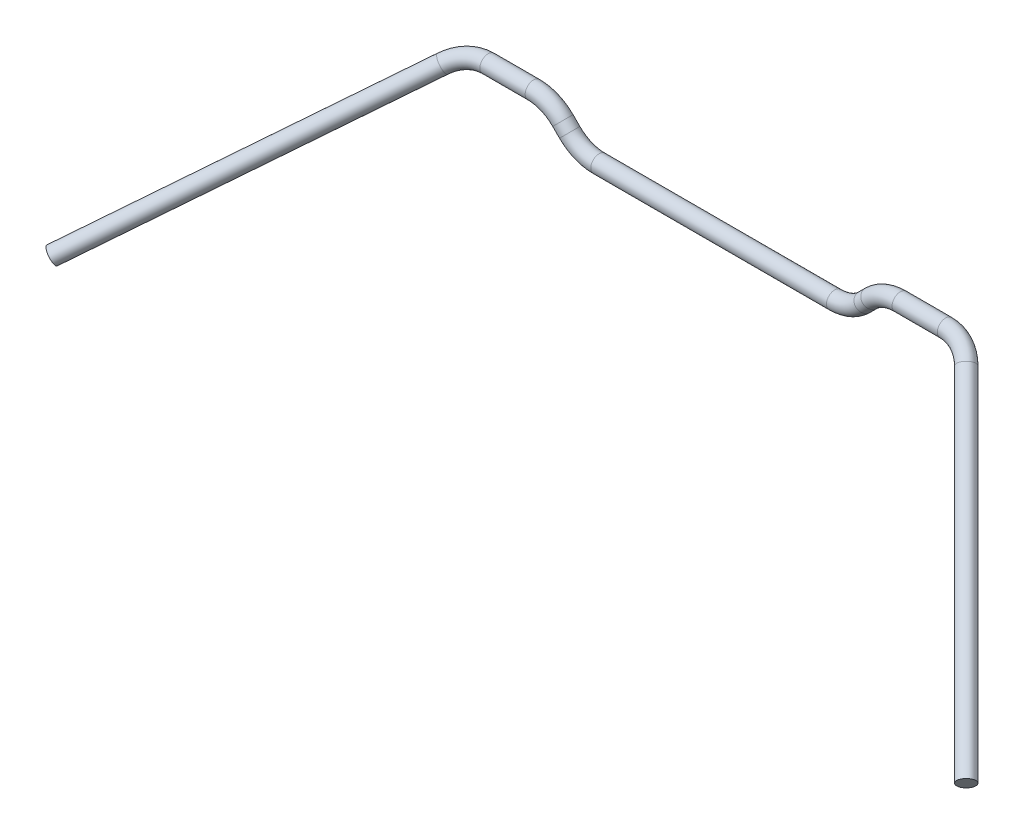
from build123d import *

# Parameters (mm, degrees)
ESQUISSE2_R = 0.4


with BuildPart() as part:
    # Balayage1: sweep along a curve in space
    with BuildLine() as balayage1_path:
        Line((0, 0, 0), (5.671572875, 0, 0))
        ThreePointArc((7.085786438, 0.585786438, 0), (6.43693974, 0.152240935, 0), (5.671572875, 0, 0))
        Line((7.085786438, 0.585786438, 0), (7.414213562, 0.914213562, 0))
        ThreePointArc((8.828427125, 1.5, 0), (8.06306026, 1.347759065, 0), (7.414213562, 0.914213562, 0))
        Line((8.828427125, 1.5, 0), (11.009478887, 1.5, 0))
        ThreePointArc((12.600315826, 0.989731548, 0.600315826), (11.897104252, 1.365444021, 0.158301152), (11.009478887, 1.5, 0))
        Line((12.600315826, 0.989731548, 0.600315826), (22, -7, 10))
    # Esquisse2 → Balayage1 (sweep)
    with BuildSketch(Plane(origin=(0, 0, 0), x_dir=(0, 0, -1), z_dir=(1, 0, 0))):
        Circle(ESQUISSE2_R)
    balayage1 = sweep(path=balayage1_path.line)

    # Sym_trie1: Balayage1 across plane
    add(balayage1.mirror(Plane(origin=(0, 0, 0), x_dir=(0, 0, 1), z_dir=(1, 0, 0))))


solid = part.part
